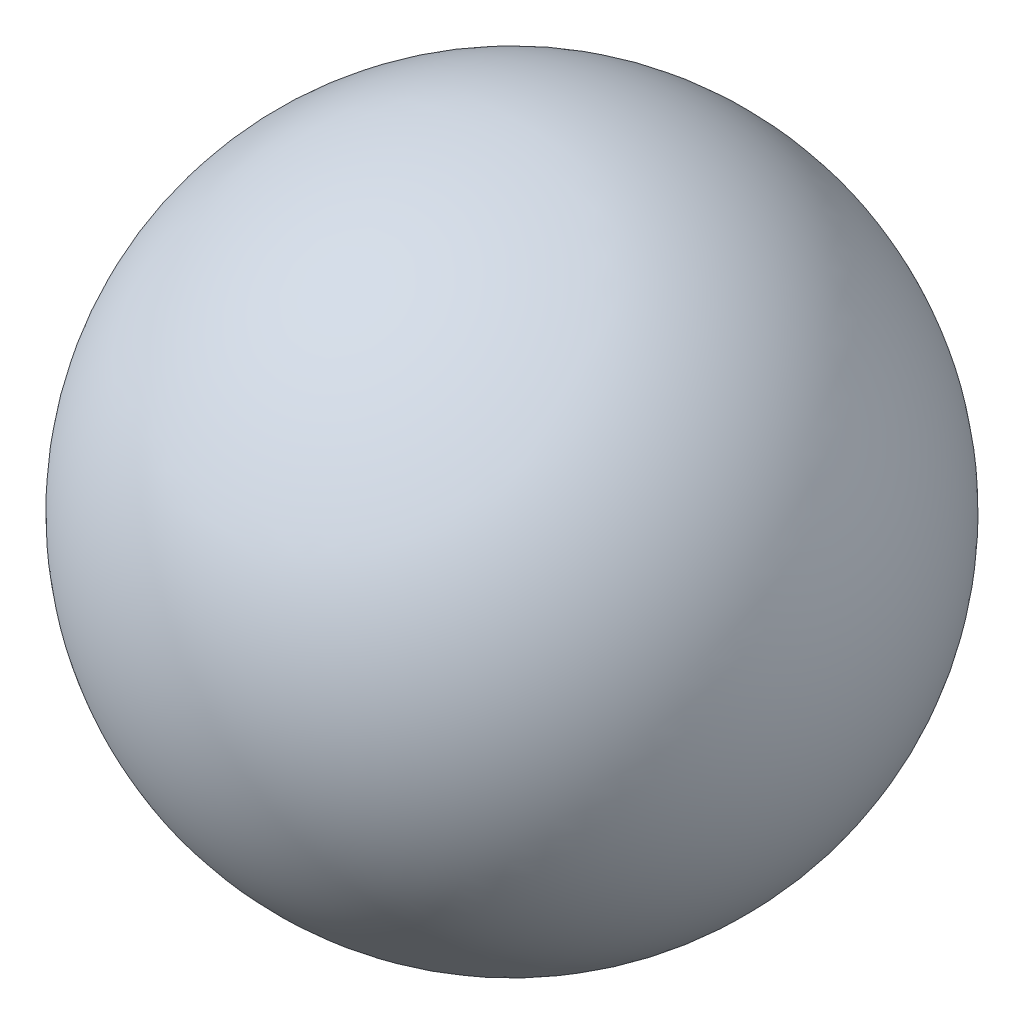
ISO-10303-21;
HEADER;
FILE_DESCRIPTION(('STEP AP214'),'2;1');
FILE_NAME('part.step','',(''),(''),'','','');
FILE_SCHEMA(('AUTOMOTIVE_DESIGN { 1 0 10303 214 1 1 1 1 }'));
ENDSEC;
DATA;
#1=APPLICATION_CONTEXT('core data for automotive mechanical design processes');
#2=APPLICATION_PROTOCOL_DEFINITION('international standard','automotive_design',2000,#1);
#3=PRODUCT_CONTEXT('',#1,'mechanical');
#4=PRODUCT('Part','Part','',(#3));
#5=PRODUCT_RELATED_PRODUCT_CATEGORY('part','',(#4));
#6=PRODUCT_DEFINITION_FORMATION('','',#4);
#7=PRODUCT_DEFINITION_CONTEXT('part definition',#1,'design');
#8=PRODUCT_DEFINITION('design','',#6,#7);
#9=PRODUCT_DEFINITION_SHAPE('','',#8);
#10=(LENGTH_UNIT() NAMED_UNIT(*) SI_UNIT(.MILLI.,.METRE.));
#11=(NAMED_UNIT(*) PLANE_ANGLE_UNIT() SI_UNIT($,.RADIAN.));
#12=(NAMED_UNIT(*) SI_UNIT($,.STERADIAN.) SOLID_ANGLE_UNIT());
#13=UNCERTAINTY_MEASURE_WITH_UNIT(LENGTH_MEASURE(1.E-05),#10,'distance_accuracy_value','');
#14=(GEOMETRIC_REPRESENTATION_CONTEXT(3) GLOBAL_UNCERTAINTY_ASSIGNED_CONTEXT((#13)) GLOBAL_UNIT_ASSIGNED_CONTEXT((#10,
#11,#12)) REPRESENTATION_CONTEXT('',''));
#15=CARTESIAN_POINT('',(0.,0.,0.));
#16=DIRECTION('',(0.,0.,1.));
#17=DIRECTION('',(1.,0.,0.));
#18=AXIS2_PLACEMENT_3D('',#15,#16,#17);
#19=CARTESIAN_POINT('',(0.,0.,0.));
#20=DIRECTION('',(0.,0.,-1.));
#21=DIRECTION('',(1.,0.,0.));
#22=AXIS2_PLACEMENT_3D('',#19,#20,#21);
#23=SPHERICAL_SURFACE('',#22,19.65);
#24=CARTESIAN_POINT('',(0.,0.,-19.65));
#25=VERTEX_POINT('',#24);
#26=VERTEX_LOOP('',#25);
#27=FACE_BOUND('',#26,.T.);
#28=ADVANCED_FACE('F11',(#27),#23,.T.);
#29=CLOSED_SHELL('',(#28));
#30=MANIFOLD_SOLID_BREP('B1',#29);
#31=ADVANCED_BREP_SHAPE_REPRESENTATION('',(#18,#30),#14);
#32=SHAPE_DEFINITION_REPRESENTATION(#9,#31);
ENDSEC;
END-ISO-10303-21;
